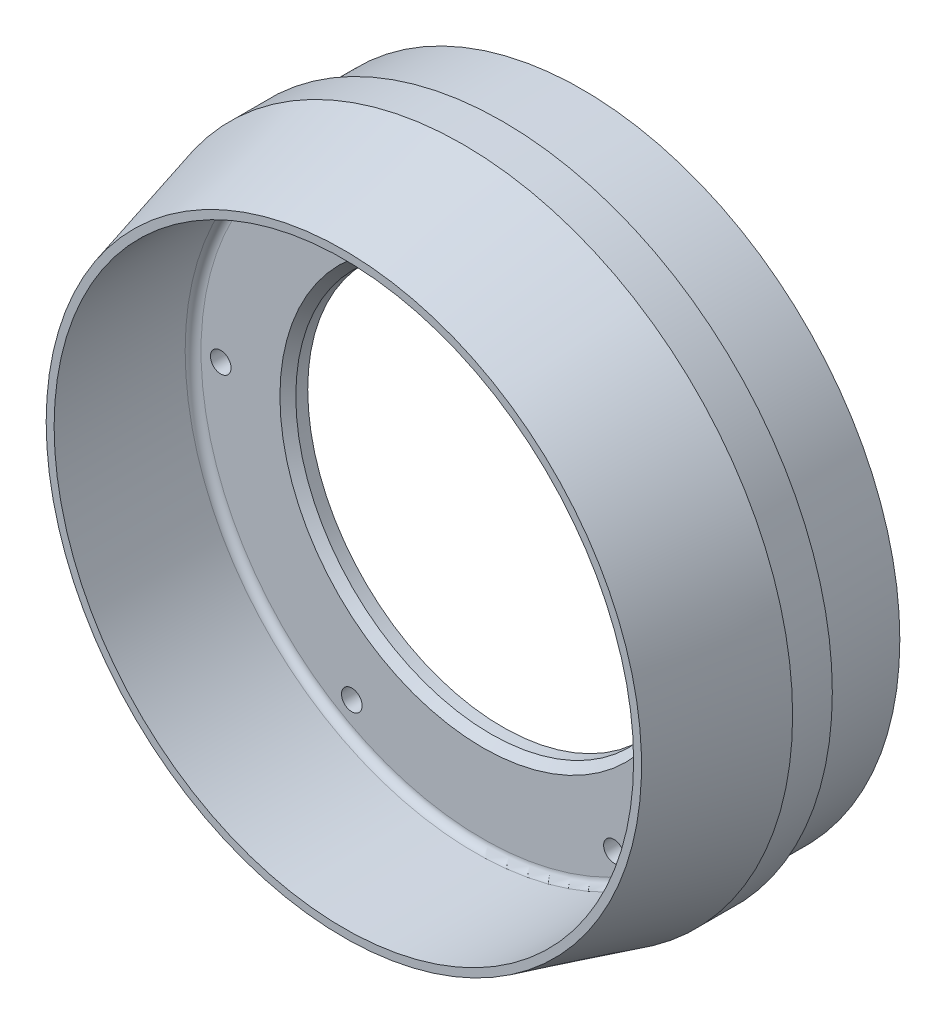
ISO-10303-21;
HEADER;
FILE_DESCRIPTION(('STEP AP214'),'2;1');
FILE_NAME('part.step','',(''),(''),'','','');
FILE_SCHEMA(('AUTOMOTIVE_DESIGN { 1 0 10303 214 1 1 1 1 }'));
ENDSEC;
DATA;
#1=APPLICATION_CONTEXT('core data for automotive mechanical design processes');
#2=APPLICATION_PROTOCOL_DEFINITION('international standard','automotive_design',2000,#1);
#3=PRODUCT_CONTEXT('',#1,'mechanical');
#4=PRODUCT('Part','Part','',(#3));
#5=PRODUCT_RELATED_PRODUCT_CATEGORY('part','',(#4));
#6=PRODUCT_DEFINITION_FORMATION('','',#4);
#7=PRODUCT_DEFINITION_CONTEXT('part definition',#1,'design');
#8=PRODUCT_DEFINITION('design','',#6,#7);
#9=PRODUCT_DEFINITION_SHAPE('','',#8);
#10=(LENGTH_UNIT() NAMED_UNIT(*) SI_UNIT(.MILLI.,.METRE.));
#11=(NAMED_UNIT(*) PLANE_ANGLE_UNIT() SI_UNIT($,.RADIAN.));
#12=(NAMED_UNIT(*) SI_UNIT($,.STERADIAN.) SOLID_ANGLE_UNIT());
#13=UNCERTAINTY_MEASURE_WITH_UNIT(LENGTH_MEASURE(1.E-05),#10,'distance_accuracy_value','');
#14=(GEOMETRIC_REPRESENTATION_CONTEXT(3) GLOBAL_UNCERTAINTY_ASSIGNED_CONTEXT((#13)) GLOBAL_UNIT_ASSIGNED_CONTEXT((#10,
#11,#12)) REPRESENTATION_CONTEXT('',''));
#15=CARTESIAN_POINT('',(0.,0.,0.));
#16=DIRECTION('',(0.,0.,1.));
#17=DIRECTION('',(1.,0.,0.));
#18=AXIS2_PLACEMENT_3D('',#15,#16,#17);
#19=CARTESIAN_POINT('',(0.,49.1,-5.));
#20=DIRECTION('',(0.,0.,-1.));
#21=DIRECTION('',(-1.,0.,0.));
#22=AXIS2_PLACEMENT_3D('',#19,#20,#21);
#23=PLANE('',#22);
#24=CARTESIAN_POINT('',(0.,0.,-5.));
#25=DIRECTION('',(0.,0.,-1.));
#26=DIRECTION('',(-1.,0.,0.));
#27=AXIS2_PLACEMENT_3D('',#24,#25,#26);
#28=CIRCLE('',#27,72.5);
#29=CARTESIAN_POINT('',(-72.5,0.,-5.));
#30=VERTEX_POINT('',#29);
#31=EDGE_CURVE('E48',#30,#30,#28,.T.);
#32=ORIENTED_EDGE('',*,*,#31,.T.);
#33=EDGE_LOOP('',(#32));
#34=FACE_BOUND('',#33,.T.);
#35=CARTESIAN_POINT('',(66.,7.04297731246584E-13,-5.));
#36=DIRECTION('',(0.,0.,-1.));
#37=DIRECTION('',(-1.,0.,0.));
#38=AXIS2_PLACEMENT_3D('',#35,#36,#37);
#39=CIRCLE('',#38,2.5908);
#40=CARTESIAN_POINT('',(63.4092,7.04297731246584E-13,-5.));
#41=VERTEX_POINT('',#40);
#42=EDGE_CURVE('E110',#41,#41,#39,.F.);
#43=ORIENTED_EDGE('',*,*,#42,.T.);
#44=EDGE_LOOP('',(#43));
#45=FACE_BOUND('',#44,.T.);
#46=CARTESIAN_POINT('',(-32.9999999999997,-57.1576766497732,-5.));
#47=DIRECTION('',(0.,0.,-1.));
#48=DIRECTION('',(-1.,0.,0.));
#49=AXIS2_PLACEMENT_3D('',#46,#47,#48);
#50=CIRCLE('',#49,2.5908);
#51=CARTESIAN_POINT('',(-35.5907999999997,-57.1576766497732,-5.));
#52=VERTEX_POINT('',#51);
#53=EDGE_CURVE('E98',#52,#52,#50,.F.);
#54=ORIENTED_EDGE('',*,*,#53,.T.);
#55=EDGE_LOOP('',(#54));
#56=FACE_BOUND('',#55,.T.);
#57=CARTESIAN_POINT('',(0.,0.,-5.));
#58=DIRECTION('',(0.,0.,-1.));
#59=DIRECTION('',(-1.,0.,0.));
#60=AXIS2_PLACEMENT_3D('',#57,#58,#59);
#61=CIRCLE('',#60,49.1);
#62=CARTESIAN_POINT('',(-49.1,0.,-5.));
#63=VERTEX_POINT('',#62);
#64=EDGE_CURVE('E65',#63,#63,#61,.T.);
#65=ORIENTED_EDGE('',*,*,#64,.F.);
#66=EDGE_LOOP('',(#65));
#67=FACE_BOUND('',#66,.T.);
#68=CARTESIAN_POINT('',(-33.0000000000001,57.1576766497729,-5.));
#69=DIRECTION('',(0.,0.,-1.));
#70=DIRECTION('',(-1.,0.,0.));
#71=AXIS2_PLACEMENT_3D('',#68,#69,#70);
#72=CIRCLE('',#71,2.5908);
#73=CARTESIAN_POINT('',(-35.5908000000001,57.1576766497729,-5.));
#74=VERTEX_POINT('',#73);
#75=EDGE_CURVE('E86',#74,#74,#72,.F.);
#76=ORIENTED_EDGE('',*,*,#75,.T.);
#77=EDGE_LOOP('',(#76));
#78=FACE_BOUND('',#77,.T.);
#79=CARTESIAN_POINT('',(-66.,-2.46330733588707E-13,-5.));
#80=DIRECTION('',(0.,0.,-1.));
#81=DIRECTION('',(-1.,0.,0.));
#82=AXIS2_PLACEMENT_3D('',#79,#80,#81);
#83=CIRCLE('',#82,2.5908);
#84=CARTESIAN_POINT('',(-68.5908,-2.46330733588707E-13,-5.));
#85=VERTEX_POINT('',#84);
#86=EDGE_CURVE('E92',#85,#85,#83,.F.);
#87=ORIENTED_EDGE('',*,*,#86,.T.);
#88=EDGE_LOOP('',(#87));
#89=FACE_BOUND('',#88,.T.);
#90=CARTESIAN_POINT('',(33.0000000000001,-57.1576766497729,-5.));
#91=DIRECTION('',(0.,0.,-1.));
#92=DIRECTION('',(-1.,0.,0.));
#93=AXIS2_PLACEMENT_3D('',#90,#91,#92);
#94=CIRCLE('',#93,2.5908);
#95=CARTESIAN_POINT('',(30.4092000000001,-57.1576766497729,-5.));
#96=VERTEX_POINT('',#95);
#97=EDGE_CURVE('E104',#96,#96,#94,.F.);
#98=ORIENTED_EDGE('',*,*,#97,.T.);
#99=EDGE_LOOP('',(#98));
#100=FACE_BOUND('',#99,.T.);
#101=CARTESIAN_POINT('',(32.9999999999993,57.1576766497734,-5.));
#102=DIRECTION('',(0.,0.,-1.));
#103=DIRECTION('',(-1.,0.,0.));
#104=AXIS2_PLACEMENT_3D('',#101,#102,#103);
#105=CIRCLE('',#104,2.5908);
#106=CARTESIAN_POINT('',(30.4091999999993,57.1576766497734,-5.));
#107=VERTEX_POINT('',#106);
#108=EDGE_CURVE('E116',#107,#107,#105,.F.);
#109=ORIENTED_EDGE('',*,*,#108,.T.);
#110=EDGE_LOOP('',(#109));
#111=FACE_BOUND('',#110,.T.);
#112=ADVANCED_FACE('F33',(#34,#45,#56,#67,#78,#89,#100,#111),#23,.T.);
#113=CARTESIAN_POINT('',(0.,0.,-77.));
#114=DIRECTION('',(0.,0.,-1.));
#115=DIRECTION('',(-1.,0.,0.));
#116=AXIS2_PLACEMENT_3D('',#113,#114,#115);
#117=CYLINDRICAL_SURFACE('',#116,49.1);
#118=CARTESIAN_POINT('',(0.,0.,-2.00000000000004));
#119=DIRECTION('',(0.,0.,1.));
#120=DIRECTION('',(1.,0.,0.));
#121=AXIS2_PLACEMENT_3D('',#118,#119,#120);
#122=CIRCLE('',#121,49.1);
#123=CARTESIAN_POINT('',(49.1,0.,-2.00000000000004));
#124=VERTEX_POINT('',#123);
#125=EDGE_CURVE('E53',#124,#124,#122,.T.);
#126=ORIENTED_EDGE('',*,*,#125,.T.);
#127=EDGE_LOOP('',(#126));
#128=FACE_BOUND('',#127,.T.);
#129=ORIENTED_EDGE('',*,*,#64,.T.);
#130=EDGE_LOOP('',(#129));
#131=FACE_BOUND('',#130,.T.);
#132=ADVANCED_FACE('F159',(#128,#131),#117,.F.);
#133=CARTESIAN_POINT('',(0.,0.,-77.));
#134=DIRECTION('',(0.,0.,-1.));
#135=DIRECTION('',(-1.,0.,0.));
#136=AXIS2_PLACEMENT_3D('',#133,#134,#135);
#137=CYLINDRICAL_SURFACE('',#136,77.5);
#138=CARTESIAN_POINT('',(0.,0.,-10.));
#139=DIRECTION('',(0.,0.,-1.));
#140=DIRECTION('',(-1.,0.,0.));
#141=AXIS2_PLACEMENT_3D('',#138,#139,#140);
#142=CIRCLE('',#141,77.5);
#143=CARTESIAN_POINT('',(-77.5,0.,-10.));
#144=VERTEX_POINT('',#143);
#145=EDGE_CURVE('E44',#144,#144,#142,.F.);
#146=ORIENTED_EDGE('',*,*,#145,.T.);
#147=EDGE_LOOP('',(#146));
#148=FACE_BOUND('',#147,.T.);
#149=CARTESIAN_POINT('',(0.,0.,-22.9999999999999));
#150=DIRECTION('',(0.,0.,-1.));
#151=DIRECTION('',(-1.,0.,0.));
#152=AXIS2_PLACEMENT_3D('',#149,#150,#151);
#153=CIRCLE('',#152,77.5);
#154=CARTESIAN_POINT('',(-77.5,0.,-22.9999999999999));
#155=VERTEX_POINT('',#154);
#156=EDGE_CURVE('E62',#155,#155,#153,.T.);
#157=ORIENTED_EDGE('',*,*,#156,.T.);
#158=EDGE_LOOP('',(#157));
#159=FACE_BOUND('',#158,.T.);
#160=ADVANCED_FACE('F165',(#148,#159),#137,.F.);
#161=CARTESIAN_POINT('',(0.,77.5,-25.));
#162=DIRECTION('',(0.,0.,-1.));
#163=DIRECTION('',(-1.,0.,0.));
#164=AXIS2_PLACEMENT_3D('',#161,#162,#163);
#165=PLANE('',#164);
#166=CARTESIAN_POINT('',(0.,0.,-25.));
#167=DIRECTION('',(0.,0.,-1.));
#168=DIRECTION('',(-1.,0.,0.));
#169=AXIS2_PLACEMENT_3D('',#166,#167,#168);
#170=CIRCLE('',#169,79.5000000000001);
#171=CARTESIAN_POINT('',(-79.5000000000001,0.,-25.));
#172=VERTEX_POINT('',#171);
#173=EDGE_CURVE('E59',#172,#172,#170,.F.);
#174=ORIENTED_EDGE('',*,*,#173,.T.);
#175=EDGE_LOOP('',(#174));
#176=FACE_BOUND('',#175,.T.);
#177=CARTESIAN_POINT('',(0.,0.,-25.));
#178=DIRECTION('',(0.,0.,-1.));
#179=DIRECTION('',(-1.,0.,0.));
#180=AXIS2_PLACEMENT_3D('',#177,#178,#179);
#181=CIRCLE('',#180,80.);
#182=CARTESIAN_POINT('',(-80.,0.,-25.));
#183=VERTEX_POINT('',#182);
#184=EDGE_CURVE('E68',#183,#183,#181,.T.);
#185=ORIENTED_EDGE('',*,*,#184,.T.);
#186=EDGE_LOOP('',(#185));
#187=FACE_BOUND('',#186,.T.);
#188=ADVANCED_FACE('F172',(#176,#187),#165,.T.);
#189=CARTESIAN_POINT('',(0.,0.,-77.));
#190=DIRECTION('',(0.,0.,-1.));
#191=DIRECTION('',(-1.,0.,0.));
#192=AXIS2_PLACEMENT_3D('',#189,#190,#191);
#193=CYLINDRICAL_SURFACE('',#192,80.);
#194=CARTESIAN_POINT('',(0.,0.,-5.));
#195=DIRECTION('',(0.,0.,-1.));
#196=DIRECTION('',(-1.,0.,0.));
#197=AXIS2_PLACEMENT_3D('',#194,#195,#196);
#198=CIRCLE('',#197,80.);
#199=CARTESIAN_POINT('',(-80.,0.,-5.));
#200=VERTEX_POINT('',#199);
#201=EDGE_CURVE('E71',#200,#200,#198,.T.);
#202=ORIENTED_EDGE('',*,*,#201,.T.);
#203=EDGE_LOOP('',(#202));
#204=FACE_BOUND('',#203,.T.);
#205=ORIENTED_EDGE('',*,*,#184,.F.);
#206=EDGE_LOOP('',(#205));
#207=FACE_BOUND('',#206,.T.);
#208=ADVANCED_FACE('F176',(#204,#207),#193,.T.);
#209=CARTESIAN_POINT('',(0.,80.,-5.));
#210=DIRECTION('',(0.,0.,-1.));
#211=DIRECTION('',(-1.,0.,0.));
#212=AXIS2_PLACEMENT_3D('',#209,#210,#211);
#213=PLANE('',#212);
#214=CARTESIAN_POINT('',(0.,0.,-5.));
#215=DIRECTION('',(0.,0.,-1.));
#216=DIRECTION('',(-1.,0.,0.));
#217=AXIS2_PLACEMENT_3D('',#214,#215,#216);
#218=CIRCLE('',#217,83.);
#219=CARTESIAN_POINT('',(-83.,0.,-5.));
#220=VERTEX_POINT('',#219);
#221=EDGE_CURVE('E74',#220,#220,#218,.T.);
#222=ORIENTED_EDGE('',*,*,#221,.T.);
#223=EDGE_LOOP('',(#222));
#224=FACE_BOUND('',#223,.T.);
#225=ORIENTED_EDGE('',*,*,#201,.F.);
#226=EDGE_LOOP('',(#225));
#227=FACE_BOUND('',#226,.T.);
#228=ADVANCED_FACE('F180',(#224,#227),#213,.T.);
#229=CARTESIAN_POINT('',(0.,0.,-77.));
#230=DIRECTION('',(0.,0.,-1.));
#231=DIRECTION('',(-1.,0.,0.));
#232=AXIS2_PLACEMENT_3D('',#229,#230,#231);
#233=CYLINDRICAL_SURFACE('',#232,83.);
#234=CARTESIAN_POINT('',(0.,0.,5.));
#235=DIRECTION('',(0.,0.,-1.));
#236=DIRECTION('',(-1.,0.,0.));
#237=AXIS2_PLACEMENT_3D('',#234,#235,#236);
#238=CIRCLE('',#237,83.);
#239=CARTESIAN_POINT('',(-83.,0.,5.));
#240=VERTEX_POINT('',#239);
#241=EDGE_CURVE('E77',#240,#240,#238,.T.);
#242=ORIENTED_EDGE('',*,*,#241,.T.);
#243=EDGE_LOOP('',(#242));
#244=FACE_BOUND('',#243,.T.);
#245=ORIENTED_EDGE('',*,*,#221,.F.);
#246=EDGE_LOOP('',(#245));
#247=FACE_BOUND('',#246,.T.);
#248=ADVANCED_FACE('F184',(#244,#247),#233,.T.);
#249=CARTESIAN_POINT('',(0.,0.,5.));
#250=DIRECTION('',(0.,0.,-1.));
#251=DIRECTION('',(-1.,0.,0.));
#252=AXIS2_PLACEMENT_3D('',#249,#250,#251);
#253=CONICAL_SURFACE('',#252,83.,0.261799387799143);
#254=CARTESIAN_POINT('',(0.,0.,35.));
#255=DIRECTION('',(0.,0.,-1.));
#256=DIRECTION('',(-1.,0.,0.));
#257=AXIS2_PLACEMENT_3D('',#254,#255,#256);
#258=CIRCLE('',#257,74.9615242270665);
#259=CARTESIAN_POINT('',(-74.9615242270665,0.,35.));
#260=VERTEX_POINT('',#259);
#261=EDGE_CURVE('E80',#260,#260,#258,.T.);
#262=ORIENTED_EDGE('',*,*,#261,.T.);
#263=EDGE_LOOP('',(#262));
#264=FACE_BOUND('',#263,.T.);
#265=ORIENTED_EDGE('',*,*,#241,.F.);
#266=EDGE_LOOP('',(#265));
#267=FACE_BOUND('',#266,.T.);
#268=ADVANCED_FACE('F188',(#264,#267),#253,.T.);
#269=CARTESIAN_POINT('',(0.,74.9615242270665,35.));
#270=DIRECTION('',(0.,0.,1.));
#271=DIRECTION('',(1.,0.,0.));
#272=AXIS2_PLACEMENT_3D('',#269,#270,#271);
#273=PLANE('',#272);
#274=CARTESIAN_POINT('',(0.,0.,35.));
#275=DIRECTION('',(0.,0.,-1.));
#276=DIRECTION('',(-1.,0.,0.));
#277=AXIS2_PLACEMENT_3D('',#274,#275,#276);
#278=CIRCLE('',#277,72.9615242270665);
#279=CARTESIAN_POINT('',(-72.9615242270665,0.,35.));
#280=VERTEX_POINT('',#279);
#281=EDGE_CURVE('E83',#280,#280,#278,.T.);
#282=ORIENTED_EDGE('',*,*,#281,.T.);
#283=EDGE_LOOP('',(#282));
#284=FACE_BOUND('',#283,.T.);
#285=ORIENTED_EDGE('',*,*,#261,.F.);
#286=EDGE_LOOP('',(#285));
#287=FACE_BOUND('',#286,.T.);
#288=ADVANCED_FACE('F192',(#284,#287),#273,.T.);
#289=CARTESIAN_POINT('',(0.,0.,-77.));
#290=DIRECTION('',(0.,0.,-1.));
#291=DIRECTION('',(-1.,0.,0.));
#292=AXIS2_PLACEMENT_3D('',#289,#290,#291);
#293=CYLINDRICAL_SURFACE('',#292,72.9615242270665);
#294=CARTESIAN_POINT('',(0.,0.,2.));
#295=DIRECTION('',(0.,0.,1.));
#296=DIRECTION('',(1.,0.,0.));
#297=AXIS2_PLACEMENT_3D('',#294,#295,#296);
#298=CIRCLE('',#297,72.9615242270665);
#299=CARTESIAN_POINT('',(72.9615242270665,0.,2.));
#300=VERTEX_POINT('',#299);
#301=EDGE_CURVE('E40',#300,#300,#298,.F.);
#302=ORIENTED_EDGE('',*,*,#301,.T.);
#303=EDGE_LOOP('',(#302));
#304=FACE_BOUND('',#303,.T.);
#305=ORIENTED_EDGE('',*,*,#281,.F.);
#306=EDGE_LOOP('',(#305));
#307=FACE_BOUND('',#306,.T.);
#308=ADVANCED_FACE('F129',(#304,#307),#293,.F.);
#309=CARTESIAN_POINT('',(0.,72.9615242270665,0.));
#310=DIRECTION('',(0.,0.,1.));
#311=DIRECTION('',(1.,0.,0.));
#312=AXIS2_PLACEMENT_3D('',#309,#310,#311);
#313=PLANE('',#312);
#314=CARTESIAN_POINT('',(0.,0.,0.));
#315=DIRECTION('',(0.,0.,1.));
#316=DIRECTION('',(1.,0.,0.));
#317=AXIS2_PLACEMENT_3D('',#314,#315,#316);
#318=CIRCLE('',#317,70.9615242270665);
#319=CARTESIAN_POINT('',(70.9615242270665,0.,0.));
#320=VERTEX_POINT('',#319);
#321=EDGE_CURVE('E10',#320,#320,#318,.T.);
#322=ORIENTED_EDGE('',*,*,#321,.T.);
#323=EDGE_LOOP('',(#322));
#324=FACE_BOUND('',#323,.T.);
#325=CARTESIAN_POINT('',(32.9999999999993,57.1576766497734,0.));
#326=DIRECTION('',(0.,0.,1.));
#327=DIRECTION('',(1.,0.,0.));
#328=AXIS2_PLACEMENT_3D('',#325,#326,#327);
#329=CIRCLE('',#328,2.5908);
#330=CARTESIAN_POINT('',(35.5907999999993,57.1576766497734,0.));
#331=VERTEX_POINT('',#330);
#332=EDGE_CURVE('E119',#331,#331,#329,.T.);
#333=ORIENTED_EDGE('',*,*,#332,.F.);
#334=EDGE_LOOP('',(#333));
#335=FACE_BOUND('',#334,.T.);
#336=CARTESIAN_POINT('',(66.,7.04297731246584E-13,0.));
#337=DIRECTION('',(0.,0.,1.));
#338=DIRECTION('',(1.,0.,0.));
#339=AXIS2_PLACEMENT_3D('',#336,#337,#338);
#340=CIRCLE('',#339,2.5908);
#341=CARTESIAN_POINT('',(68.5908,7.04297731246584E-13,0.));
#342=VERTEX_POINT('',#341);
#343=EDGE_CURVE('E113',#342,#342,#340,.T.);
#344=ORIENTED_EDGE('',*,*,#343,.F.);
#345=EDGE_LOOP('',(#344));
#346=FACE_BOUND('',#345,.T.);
#347=CARTESIAN_POINT('',(33.0000000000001,-57.1576766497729,0.));
#348=DIRECTION('',(0.,0.,1.));
#349=DIRECTION('',(1.,0.,0.));
#350=AXIS2_PLACEMENT_3D('',#347,#348,#349);
#351=CIRCLE('',#350,2.5908);
#352=CARTESIAN_POINT('',(35.5908000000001,-57.1576766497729,0.));
#353=VERTEX_POINT('',#352);
#354=EDGE_CURVE('E107',#353,#353,#351,.T.);
#355=ORIENTED_EDGE('',*,*,#354,.F.);
#356=EDGE_LOOP('',(#355));
#357=FACE_BOUND('',#356,.T.);
#358=CARTESIAN_POINT('',(-32.9999999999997,-57.1576766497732,0.));
#359=DIRECTION('',(0.,0.,1.));
#360=DIRECTION('',(1.,0.,0.));
#361=AXIS2_PLACEMENT_3D('',#358,#359,#360);
#362=CIRCLE('',#361,2.5908);
#363=CARTESIAN_POINT('',(-30.4091999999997,-57.1576766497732,0.));
#364=VERTEX_POINT('',#363);
#365=EDGE_CURVE('E101',#364,#364,#362,.T.);
#366=ORIENTED_EDGE('',*,*,#365,.F.);
#367=EDGE_LOOP('',(#366));
#368=FACE_BOUND('',#367,.T.);
#369=CARTESIAN_POINT('',(-66.,-2.46330733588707E-13,0.));
#370=DIRECTION('',(0.,0.,1.));
#371=DIRECTION('',(1.,0.,0.));
#372=AXIS2_PLACEMENT_3D('',#369,#370,#371);
#373=CIRCLE('',#372,2.5908);
#374=CARTESIAN_POINT('',(-63.4092,-2.46330733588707E-13,0.));
#375=VERTEX_POINT('',#374);
#376=EDGE_CURVE('E95',#375,#375,#373,.T.);
#377=ORIENTED_EDGE('',*,*,#376,.F.);
#378=EDGE_LOOP('',(#377));
#379=FACE_BOUND('',#378,.T.);
#380=CARTESIAN_POINT('',(-33.0000000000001,57.1576766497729,0.));
#381=DIRECTION('',(0.,0.,1.));
#382=DIRECTION('',(1.,0.,0.));
#383=AXIS2_PLACEMENT_3D('',#380,#381,#382);
#384=CIRCLE('',#383,2.5908);
#385=CARTESIAN_POINT('',(-30.4092000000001,57.1576766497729,0.));
#386=VERTEX_POINT('',#385);
#387=EDGE_CURVE('E89',#386,#386,#384,.T.);
#388=ORIENTED_EDGE('',*,*,#387,.F.);
#389=EDGE_LOOP('',(#388));
#390=FACE_BOUND('',#389,.T.);
#391=CARTESIAN_POINT('',(0.,0.,0.));
#392=DIRECTION('',(0.,0.,1.));
#393=DIRECTION('',(1.,0.,0.));
#394=AXIS2_PLACEMENT_3D('',#391,#392,#393);
#395=CIRCLE('',#394,51.1000000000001);
#396=CARTESIAN_POINT('',(51.1000000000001,0.,0.));
#397=VERTEX_POINT('',#396);
#398=EDGE_CURVE('E56',#397,#397,#395,.F.);
#399=ORIENTED_EDGE('',*,*,#398,.T.);
#400=EDGE_LOOP('',(#399));
#401=FACE_BOUND('',#400,.T.);
#402=ADVANCED_FACE('F125',(#324,#335,#346,#357,#368,#379,#390,#401),#313,.T.);
#403=CARTESIAN_POINT('',(0.,0.,-22.9999999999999));
#404=DIRECTION('',(0.,0.,-1.));
#405=DIRECTION('',(-1.,0.,0.));
#406=AXIS2_PLACEMENT_3D('',#403,#404,#405);
#407=CONICAL_SURFACE('',#406,77.5,0.785398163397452);
#408=ORIENTED_EDGE('',*,*,#173,.F.);
#409=EDGE_LOOP('',(#408));
#410=FACE_BOUND('',#409,.T.);
#411=ORIENTED_EDGE('',*,*,#156,.F.);
#412=EDGE_LOOP('',(#411));
#413=FACE_BOUND('',#412,.T.);
#414=ADVANCED_FACE('F128',(#410,#413),#407,.F.);
#415=CARTESIAN_POINT('',(0.,0.,0.));
#416=DIRECTION('',(0.,0.,1.));
#417=DIRECTION('',(1.,0.,0.));
#418=AXIS2_PLACEMENT_3D('',#415,#416,#417);
#419=CONICAL_SURFACE('',#418,51.1000000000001,0.785398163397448);
#420=ORIENTED_EDGE('',*,*,#125,.F.);
#421=EDGE_LOOP('',(#420));
#422=FACE_BOUND('',#421,.T.);
#423=ORIENTED_EDGE('',*,*,#398,.F.);
#424=EDGE_LOOP('',(#423));
#425=FACE_BOUND('',#424,.T.);
#426=ADVANCED_FACE('F143',(#422,#425),#419,.F.);
#427=CARTESIAN_POINT('',(-33.0000000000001,57.1576766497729,0.));
#428=DIRECTION('',(0.,0.,1.));
#429=DIRECTION('',(1.,0.,0.));
#430=AXIS2_PLACEMENT_3D('',#427,#428,#429);
#431=CYLINDRICAL_SURFACE('',#430,2.5908);
#432=ORIENTED_EDGE('',*,*,#75,.F.);
#433=EDGE_LOOP('',(#432));
#434=FACE_BOUND('',#433,.T.);
#435=ORIENTED_EDGE('',*,*,#387,.T.);
#436=EDGE_LOOP('',(#435));
#437=FACE_BOUND('',#436,.T.);
#438=ADVANCED_FACE('F145',(#434,#437),#431,.F.);
#439=CARTESIAN_POINT('',(-66.,-2.46330733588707E-13,0.));
#440=DIRECTION('',(0.,0.,1.));
#441=DIRECTION('',(1.,0.,0.));
#442=AXIS2_PLACEMENT_3D('',#439,#440,#441);
#443=CYLINDRICAL_SURFACE('',#442,2.5908);
#444=ORIENTED_EDGE('',*,*,#86,.F.);
#445=EDGE_LOOP('',(#444));
#446=FACE_BOUND('',#445,.T.);
#447=ORIENTED_EDGE('',*,*,#376,.T.);
#448=EDGE_LOOP('',(#447));
#449=FACE_BOUND('',#448,.T.);
#450=ADVANCED_FACE('F152',(#446,#449),#443,.F.);
#451=CARTESIAN_POINT('',(-32.9999999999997,-57.1576766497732,0.));
#452=DIRECTION('',(0.,0.,1.));
#453=DIRECTION('',(1.,0.,0.));
#454=AXIS2_PLACEMENT_3D('',#451,#452,#453);
#455=CYLINDRICAL_SURFACE('',#454,2.5908);
#456=ORIENTED_EDGE('',*,*,#53,.F.);
#457=EDGE_LOOP('',(#456));
#458=FACE_BOUND('',#457,.T.);
#459=ORIENTED_EDGE('',*,*,#365,.T.);
#460=EDGE_LOOP('',(#459));
#461=FACE_BOUND('',#460,.T.);
#462=ADVANCED_FACE('F201',(#458,#461),#455,.F.);
#463=CARTESIAN_POINT('',(33.0000000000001,-57.1576766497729,0.));
#464=DIRECTION('',(0.,0.,1.));
#465=DIRECTION('',(1.,0.,0.));
#466=AXIS2_PLACEMENT_3D('',#463,#464,#465);
#467=CYLINDRICAL_SURFACE('',#466,2.5908);
#468=ORIENTED_EDGE('',*,*,#97,.F.);
#469=EDGE_LOOP('',(#468));
#470=FACE_BOUND('',#469,.T.);
#471=ORIENTED_EDGE('',*,*,#354,.T.);
#472=EDGE_LOOP('',(#471));
#473=FACE_BOUND('',#472,.T.);
#474=ADVANCED_FACE('F205',(#470,#473),#467,.F.);
#475=CARTESIAN_POINT('',(66.,7.04297731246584E-13,0.));
#476=DIRECTION('',(0.,0.,1.));
#477=DIRECTION('',(1.,0.,0.));
#478=AXIS2_PLACEMENT_3D('',#475,#476,#477);
#479=CYLINDRICAL_SURFACE('',#478,2.5908);
#480=ORIENTED_EDGE('',*,*,#42,.F.);
#481=EDGE_LOOP('',(#480));
#482=FACE_BOUND('',#481,.T.);
#483=ORIENTED_EDGE('',*,*,#343,.T.);
#484=EDGE_LOOP('',(#483));
#485=FACE_BOUND('',#484,.T.);
#486=ADVANCED_FACE('F209',(#482,#485),#479,.F.);
#487=CARTESIAN_POINT('',(32.9999999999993,57.1576766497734,0.));
#488=DIRECTION('',(0.,0.,1.));
#489=DIRECTION('',(1.,0.,0.));
#490=AXIS2_PLACEMENT_3D('',#487,#488,#489);
#491=CYLINDRICAL_SURFACE('',#490,2.5908);
#492=ORIENTED_EDGE('',*,*,#108,.F.);
#493=EDGE_LOOP('',(#492));
#494=FACE_BOUND('',#493,.T.);
#495=ORIENTED_EDGE('',*,*,#332,.T.);
#496=EDGE_LOOP('',(#495));
#497=FACE_BOUND('',#496,.T.);
#498=ADVANCED_FACE('F123',(#494,#497),#491,.F.);
#499=CARTESIAN_POINT('',(0.,0.,-10.));
#500=DIRECTION('',(0.,0.,-1.));
#501=DIRECTION('',(-1.,0.,0.));
#502=AXIS2_PLACEMENT_3D('',#499,#500,#501);
#503=TOROIDAL_SURFACE('',#502,72.5,5.);
#504=ORIENTED_EDGE('',*,*,#145,.F.);
#505=EDGE_LOOP('',(#504));
#506=FACE_BOUND('',#505,.T.);
#507=ORIENTED_EDGE('',*,*,#31,.F.);
#508=EDGE_LOOP('',(#507));
#509=FACE_BOUND('',#508,.T.);
#510=ADVANCED_FACE('F215',(#506,#509),#503,.F.);
#511=CARTESIAN_POINT('',(0.,0.,2.));
#512=DIRECTION('',(0.,0.,1.));
#513=DIRECTION('',(1.,0.,0.));
#514=AXIS2_PLACEMENT_3D('',#511,#512,#513);
#515=TOROIDAL_SURFACE('',#514,70.9615242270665,2.);
#516=ORIENTED_EDGE('',*,*,#321,.F.);
#517=EDGE_LOOP('',(#516));
#518=FACE_BOUND('',#517,.T.);
#519=ORIENTED_EDGE('',*,*,#301,.F.);
#520=EDGE_LOOP('',(#519));
#521=FACE_BOUND('',#520,.T.);
#522=ADVANCED_FACE('F35',(#518,#521),#515,.F.);
#523=CLOSED_SHELL('',(#112,#132,#160,#188,#208,#228,#248,#268,#288,#308,#402,#414,#426,#438,
#450,#462,#474,#486,#498,#510,#522));
#524=MANIFOLD_SOLID_BREP('B2',#523);
#525=ADVANCED_BREP_SHAPE_REPRESENTATION('',(#18,#524),#14);
#526=SHAPE_DEFINITION_REPRESENTATION(#9,#525);
ENDSEC;
END-ISO-10303-21;
